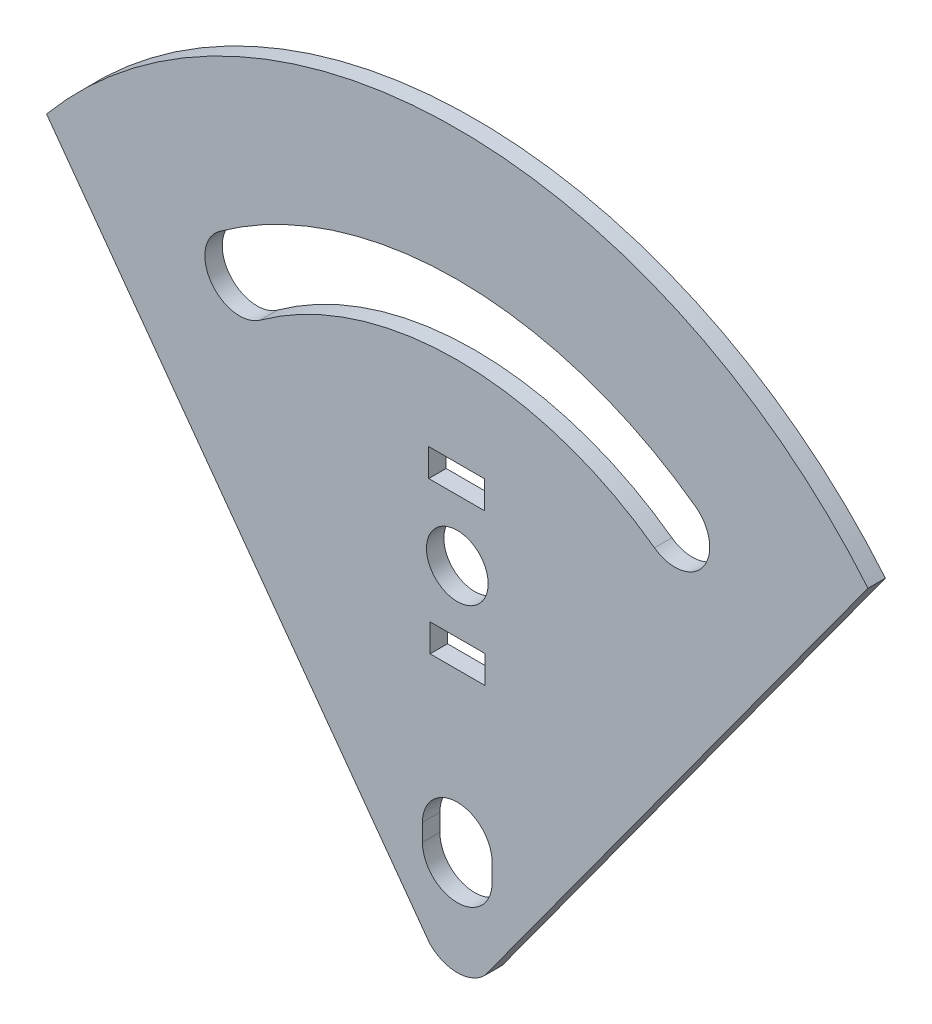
from build123d import *

# Parameters (mm, degrees)
BOSS_EXTRUDE1_DEPTH  = 2.54
SKETCH2_R            = 4.00687886
SKETCH2_W            = 8.128
SKETCH2_H            = 4.038823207
CUT_EXTRUDE1_DEPTH   = 11.176
M8_CLEARANCE_HOLE1_D = 9


with BuildPart() as part:
    # Sketch1 → Boss-Extrude1 (new body)
    with BuildSketch(Plane.XY):
        with BuildLine():
            Line((0, 0), (-59.924516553, 82.389363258))
            ThreePointArc((-59.924516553, 82.389363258), (0, 110.49), (59.924516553, 82.389363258))
            Line((59.924516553, 82.389363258), (0, 0))
        make_face()
        with BuildLine():
            Line((5.08, 20.32), (5.08, 17.78))
            ThreePointArc((5.08, 17.78), (0, 12.7), (-5.08, 17.78))
            Line((-5.08, 17.78), (-5.08, 20.32))
            ThreePointArc((-5.08, 20.32), (0, 25.4), (5.08, 20.32))
        make_face(mode=Mode.SUBTRACT)
        with BuildLine():
            ThreePointArc((34.736987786, 80.148414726), (0, 91.44), (-34.736987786, 80.148414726))
            ThreePointArc((-34.736987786, 80.148414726), (-35.859051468, 73.052375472), (-28.763012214, 71.93031179))
            ThreePointArc((-28.763012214, 71.93031179), (0, 81.28), (28.763012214, 71.93031179))
            ThreePointArc((28.763012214, 71.93031179), (35.859051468, 73.052375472), (34.736987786, 80.148414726))
        make_face(mode=Mode.SUBTRACT)
    extrude(amount=BOSS_EXTRUDE1_DEPTH)

    # Sketch2 → Cut-Extrude1 (cut)
    with BuildSketch(Plane.XY.offset(2.54)):
        with Locations((0, 55.245)):
            Circle(SKETCH2_R)
        with BuildLine():
            Line((-4.00687886, 5.509000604), (0, 0))
            Line((0, 0), (4.00687886, 5.509000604))
            ThreePointArc((4.00687886, 5.509000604), (0, 3.849297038), (-4.00687886, 5.509000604))
        make_face()
        Polygon((0.041323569, 46.201729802), (-3.965555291, 46.201729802), (-3.965555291, 42.162906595), (4.048202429, 42.162906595), (4.048202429, 46.201729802), align=None)
        with Locations((-0.102542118, 66.229798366)):
            Rectangle(SKETCH2_W, SKETCH2_H)
    extrude(amount=-CUT_EXTRUDE1_DEPTH, mode=Mode.SUBTRACT)

    # M8 Clearance Hole1 (through all)
    with Locations(Plane.XY.offset(2.54)):
        with Locations((0, 55.245)):
            Hole(M8_CLEARANCE_HOLE1_D / 2)


solid = part.part
